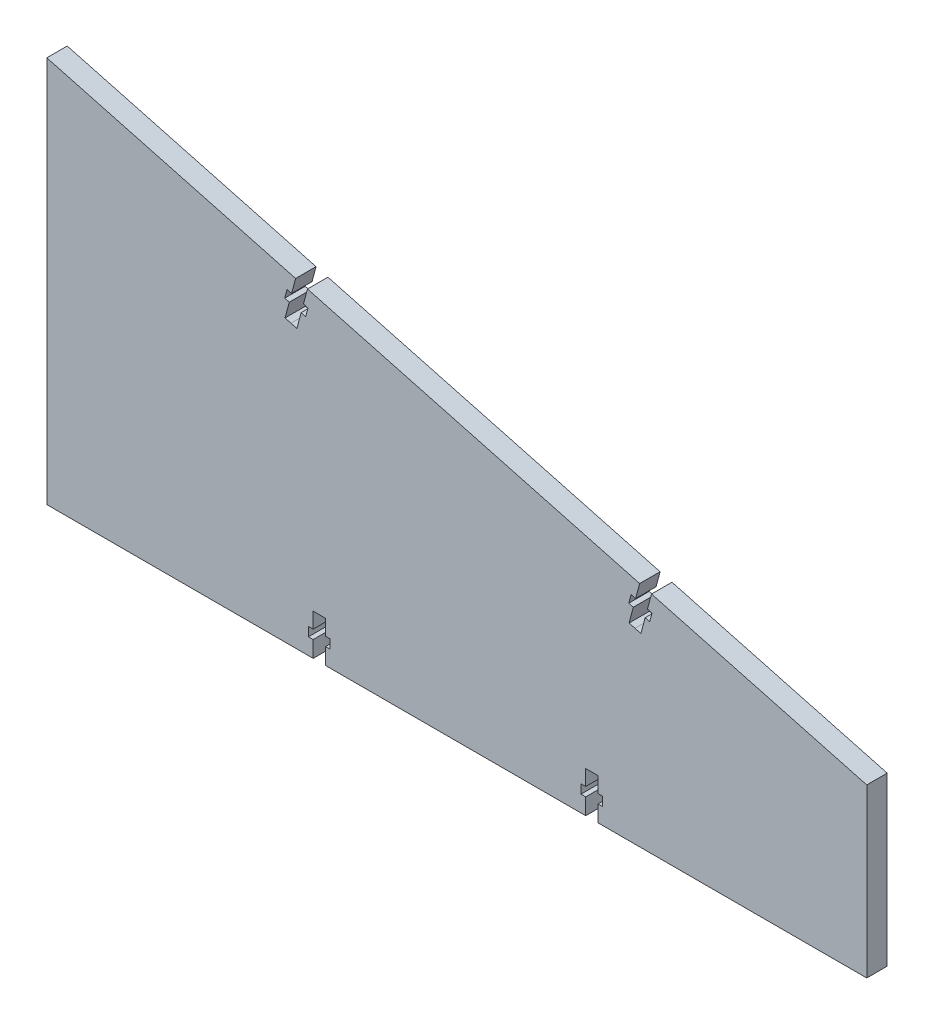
from build123d import *

# Parameters (mm, degrees)
BOSS_EXTRUDE1_DEPTH = 5


with BuildPart() as part:
    # Sketch1 → Boss-Extrude1 (new body)
    with BuildSketch(Plane.XY.offset(5)):
        Polygon((10.670610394, -39.779115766), (10.670610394, -41.978528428), (9.520917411, -41.978528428), (9.520917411, -45.977460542), (75.249741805, -45.977460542), (75.249741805, -5.083714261), (22.606794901, 9.021963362), (21.623279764, 5.351445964), (22.73409424, 5.053803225), (22.164690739, 2.928766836), (21.053876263, 3.226409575), (20.018597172, -0.63729295), (18.569708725, -0.249063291), (17.120846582, 0.139264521), (18.156387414, 4.002896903), (17.045593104, 4.300614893), (17.615140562, 6.425612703), (18.725934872, 6.127894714), (19.709698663, 9.798345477), (-61.525955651, 31.56543905), (-62.509222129, 27.894855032), (-61.398387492, 27.597287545), (-61.967647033, 25.472212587), (-63.078481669, 25.769780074), (-64.113499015, 21.906007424), (-65.562413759, 22.294138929), (-67.011302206, 22.682368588), (-65.976023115, 26.546071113), (-67.086837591, 26.843713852), (-66.51743409, 28.968750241), (-65.406619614, 28.671107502), (-64.423104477, 32.341624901), (-125.276419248, 48.647270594), (-125.276419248, -45.977460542), (-60.127150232, -45.977460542), (-60.127150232, -41.978528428), (-61.276843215, -41.978528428), (-61.276843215, -39.779115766), (-60.127150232, -39.779115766), (-60.127150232, -35.980130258), (-57.127951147, -35.980130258), (-57.127951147, -39.779115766), (-55.978258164, -39.779115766), (-55.978258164, -41.978528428), (-57.127951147, -41.978528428), (-57.127951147, -45.977460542), (6.521718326, -45.977460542), (6.521718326, -41.978528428), (5.372025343, -41.978528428), (5.372025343, -39.779115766), (6.521718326, -39.779115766), (6.521718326, -35.980130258), (9.520917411, -35.980130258), (9.520917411, -39.779115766), align=None)
    extrude(amount=-BOSS_EXTRUDE1_DEPTH)


solid = part.part
